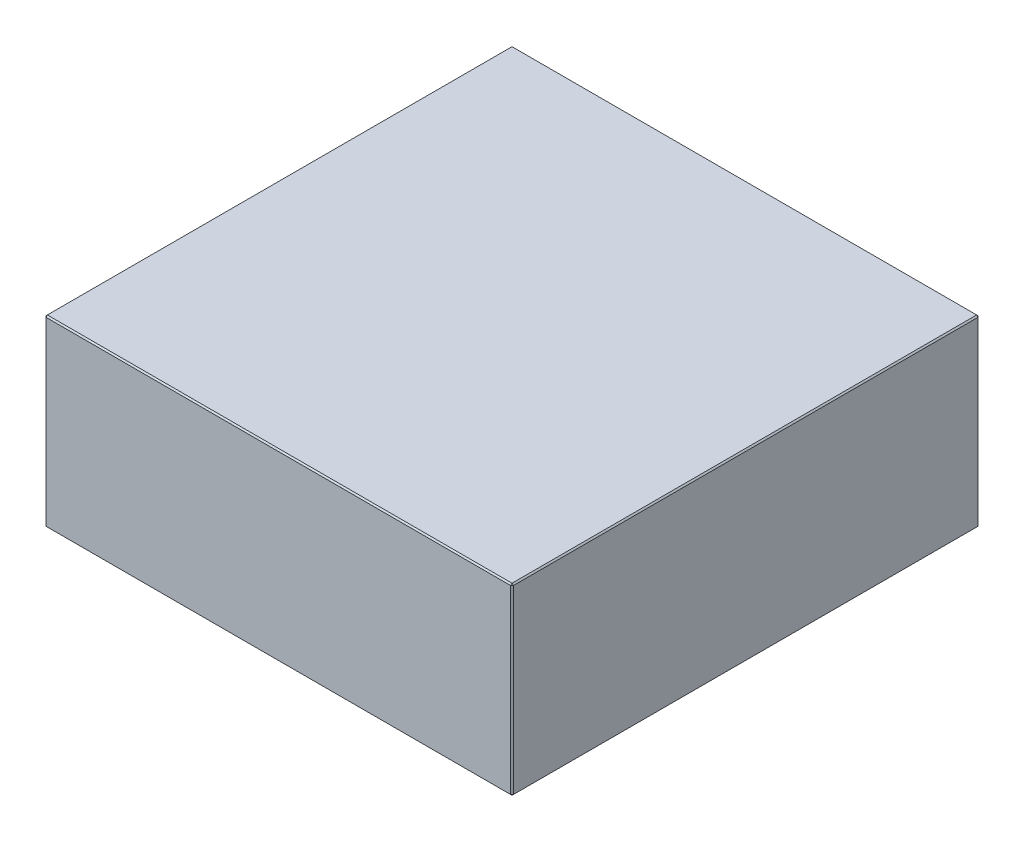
ISO-10303-21;
HEADER;
FILE_DESCRIPTION(('STEP AP214'),'2;1');
FILE_NAME('part.step','',(''),(''),'','','');
FILE_SCHEMA(('AUTOMOTIVE_DESIGN { 1 0 10303 214 1 1 1 1 }'));
ENDSEC;
DATA;
#1=APPLICATION_CONTEXT('core data for automotive mechanical design processes');
#2=APPLICATION_PROTOCOL_DEFINITION('international standard','automotive_design',2000,#1);
#3=PRODUCT_CONTEXT('',#1,'mechanical');
#4=PRODUCT('Part','Part','',(#3));
#5=PRODUCT_RELATED_PRODUCT_CATEGORY('part','',(#4));
#6=PRODUCT_DEFINITION_FORMATION('','',#4);
#7=PRODUCT_DEFINITION_CONTEXT('part definition',#1,'design');
#8=PRODUCT_DEFINITION('design','',#6,#7);
#9=PRODUCT_DEFINITION_SHAPE('','',#8);
#10=(LENGTH_UNIT() NAMED_UNIT(*) SI_UNIT(.MILLI.,.METRE.));
#11=(NAMED_UNIT(*) PLANE_ANGLE_UNIT() SI_UNIT($,.RADIAN.));
#12=(NAMED_UNIT(*) SI_UNIT($,.STERADIAN.) SOLID_ANGLE_UNIT());
#13=UNCERTAINTY_MEASURE_WITH_UNIT(LENGTH_MEASURE(1.E-05),#10,'distance_accuracy_value','');
#14=(GEOMETRIC_REPRESENTATION_CONTEXT(3) GLOBAL_UNCERTAINTY_ASSIGNED_CONTEXT((#13)) GLOBAL_UNIT_ASSIGNED_CONTEXT((#10,
#11,#12)) REPRESENTATION_CONTEXT('',''));
#15=CARTESIAN_POINT('',(0.,0.,0.));
#16=DIRECTION('',(0.,0.,1.));
#17=DIRECTION('',(1.,0.,0.));
#18=AXIS2_PLACEMENT_3D('',#15,#16,#17);
#19=CARTESIAN_POINT('',(-173.,136.,173.));
#20=DIRECTION('',(1.,0.,0.));
#21=DIRECTION('',(0.,0.,-1.));
#22=AXIS2_PLACEMENT_3D('',#19,#20,#21);
#23=PLANE('',#22);
#24=DIRECTION('',(0.,-1.,0.));
#25=VECTOR('',#24,1.);
#26=CARTESIAN_POINT('',(-173.,136.,-172.));
#27=LINE('',#26,#25);
#28=CARTESIAN_POINT('',(-173.,135.,-172.));
#29=VERTEX_POINT('',#28);
#30=CARTESIAN_POINT('',(-173.,1.,-172.));
#31=VERTEX_POINT('',#30);
#32=EDGE_CURVE('E114',#29,#31,#27,.T.);
#33=ORIENTED_EDGE('',*,*,#32,.T.);
#34=DIRECTION('',(0.,0.,1.));
#35=VECTOR('',#34,1.);
#36=CARTESIAN_POINT('',(-173.,1.,173.));
#37=LINE('',#36,#35);
#38=CARTESIAN_POINT('',(-173.,1.,172.));
#39=VERTEX_POINT('',#38);
#40=EDGE_CURVE('E110',#31,#39,#37,.T.);
#41=ORIENTED_EDGE('',*,*,#40,.T.);
#42=DIRECTION('',(0.,1.,0.));
#43=VECTOR('',#42,1.);
#44=CARTESIAN_POINT('',(-173.,136.,172.));
#45=LINE('',#44,#43);
#46=CARTESIAN_POINT('',(-173.,135.,172.));
#47=VERTEX_POINT('',#46);
#48=EDGE_CURVE('E103',#39,#47,#45,.T.);
#49=ORIENTED_EDGE('',*,*,#48,.T.);
#50=DIRECTION('',(0.,0.,-1.));
#51=VECTOR('',#50,1.);
#52=CARTESIAN_POINT('',(-173.,135.,-173.));
#53=LINE('',#52,#51);
#54=EDGE_CURVE('E107',#47,#29,#53,.T.);
#55=ORIENTED_EDGE('',*,*,#54,.T.);
#56=EDGE_LOOP('',(#33,#41,#49,#55));
#57=FACE_BOUND('',#56,.T.);
#58=ADVANCED_FACE('F15',(#57),#23,.F.);
#59=CARTESIAN_POINT('',(173.,136.,173.));
#60=DIRECTION('',(0.,0.,-1.));
#61=DIRECTION('',(-1.,0.,0.));
#62=AXIS2_PLACEMENT_3D('',#59,#60,#61);
#63=PLANE('',#62);
#64=DIRECTION('',(-1.,0.,0.));
#65=VECTOR('',#64,1.);
#66=CARTESIAN_POINT('',(-173.,135.,173.));
#67=LINE('',#66,#65);
#68=CARTESIAN_POINT('',(172.,135.,173.));
#69=VERTEX_POINT('',#68);
#70=CARTESIAN_POINT('',(-172.,135.,173.));
#71=VERTEX_POINT('',#70);
#72=EDGE_CURVE('E164',#69,#71,#67,.T.);
#73=ORIENTED_EDGE('',*,*,#72,.T.);
#74=DIRECTION('',(0.,-1.,0.));
#75=VECTOR('',#74,1.);
#76=CARTESIAN_POINT('',(-172.,136.,173.));
#77=LINE('',#76,#75);
#78=CARTESIAN_POINT('',(-172.,1.00000000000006,173.));
#79=VERTEX_POINT('',#78);
#80=EDGE_CURVE('E122',#71,#79,#77,.T.);
#81=ORIENTED_EDGE('',*,*,#80,.T.);
#82=DIRECTION('',(1.,0.,0.));
#83=VECTOR('',#82,1.);
#84=CARTESIAN_POINT('',(173.,1.00000000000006,173.));
#85=LINE('',#84,#83);
#86=CARTESIAN_POINT('',(172.,1.00000000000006,173.));
#87=VERTEX_POINT('',#86);
#88=EDGE_CURVE('E168',#79,#87,#85,.T.);
#89=ORIENTED_EDGE('',*,*,#88,.T.);
#90=DIRECTION('',(0.,1.,0.));
#91=VECTOR('',#90,1.);
#92=CARTESIAN_POINT('',(172.,136.,173.));
#93=LINE('',#92,#91);
#94=EDGE_CURVE('E166',#87,#69,#93,.T.);
#95=ORIENTED_EDGE('',*,*,#94,.T.);
#96=EDGE_LOOP('',(#73,#81,#89,#95));
#97=FACE_BOUND('',#96,.T.);
#98=ADVANCED_FACE('F275',(#97),#63,.F.);
#99=CARTESIAN_POINT('',(173.,136.,173.));
#100=DIRECTION('',(-1.,0.,0.));
#101=DIRECTION('',(0.,0.,1.));
#102=AXIS2_PLACEMENT_3D('',#99,#100,#101);
#103=PLANE('',#102);
#104=DIRECTION('',(0.,0.,-1.));
#105=VECTOR('',#104,1.);
#106=CARTESIAN_POINT('',(173.,1.00000000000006,173.));
#107=LINE('',#106,#105);
#108=CARTESIAN_POINT('',(173.,1.00000000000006,172.));
#109=VERTEX_POINT('',#108);
#110=CARTESIAN_POINT('',(173.,1.00000000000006,-172.));
#111=VERTEX_POINT('',#110);
#112=EDGE_CURVE('E159',#109,#111,#107,.T.);
#113=ORIENTED_EDGE('',*,*,#112,.T.);
#114=DIRECTION('',(0.,1.,0.));
#115=VECTOR('',#114,1.);
#116=CARTESIAN_POINT('',(173.,136.,-172.));
#117=LINE('',#116,#115);
#118=CARTESIAN_POINT('',(173.,135.,-172.));
#119=VERTEX_POINT('',#118);
#120=EDGE_CURVE('E161',#111,#119,#117,.T.);
#121=ORIENTED_EDGE('',*,*,#120,.T.);
#122=DIRECTION('',(0.,0.,1.));
#123=VECTOR('',#122,1.);
#124=CARTESIAN_POINT('',(173.,135.,173.));
#125=LINE('',#124,#123);
#126=CARTESIAN_POINT('',(173.,135.,172.));
#127=VERTEX_POINT('',#126);
#128=EDGE_CURVE('E155',#119,#127,#125,.T.);
#129=ORIENTED_EDGE('',*,*,#128,.T.);
#130=DIRECTION('',(0.,-1.,0.));
#131=VECTOR('',#130,1.);
#132=CARTESIAN_POINT('',(173.,136.,172.));
#133=LINE('',#132,#131);
#134=EDGE_CURVE('E157',#127,#109,#133,.T.);
#135=ORIENTED_EDGE('',*,*,#134,.T.);
#136=EDGE_LOOP('',(#113,#121,#129,#135));
#137=FACE_BOUND('',#136,.T.);
#138=ADVANCED_FACE('F254',(#137),#103,.F.);
#139=CARTESIAN_POINT('',(173.,136.,-173.));
#140=DIRECTION('',(0.,0.,1.));
#141=DIRECTION('',(1.,0.,0.));
#142=AXIS2_PLACEMENT_3D('',#139,#140,#141);
#143=PLANE('',#142);
#144=DIRECTION('',(0.,-1.,0.));
#145=VECTOR('',#144,1.);
#146=CARTESIAN_POINT('',(172.,136.,-173.));
#147=LINE('',#146,#145);
#148=CARTESIAN_POINT('',(172.,135.,-173.));
#149=VERTEX_POINT('',#148);
#150=CARTESIAN_POINT('',(172.,1.00000000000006,-173.));
#151=VERTEX_POINT('',#150);
#152=EDGE_CURVE('E148',#149,#151,#147,.T.);
#153=ORIENTED_EDGE('',*,*,#152,.T.);
#154=DIRECTION('',(-1.,0.,0.));
#155=VECTOR('',#154,1.);
#156=CARTESIAN_POINT('',(173.,1.00000000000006,-173.));
#157=LINE('',#156,#155);
#158=CARTESIAN_POINT('',(-172.,1.00000000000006,-173.));
#159=VERTEX_POINT('',#158);
#160=EDGE_CURVE('E153',#151,#159,#157,.T.);
#161=ORIENTED_EDGE('',*,*,#160,.T.);
#162=DIRECTION('',(0.,1.,0.));
#163=VECTOR('',#162,1.);
#164=CARTESIAN_POINT('',(-172.,136.,-173.));
#165=LINE('',#164,#163);
#166=CARTESIAN_POINT('',(-172.,135.,-173.));
#167=VERTEX_POINT('',#166);
#168=EDGE_CURVE('E150',#159,#167,#165,.T.);
#169=ORIENTED_EDGE('',*,*,#168,.T.);
#170=DIRECTION('',(1.,0.,0.));
#171=VECTOR('',#170,1.);
#172=CARTESIAN_POINT('',(173.,135.,-173.));
#173=LINE('',#172,#171);
#174=EDGE_CURVE('E146',#167,#149,#173,.T.);
#175=ORIENTED_EDGE('',*,*,#174,.T.);
#176=EDGE_LOOP('',(#153,#161,#169,#175));
#177=FACE_BOUND('',#176,.T.);
#178=ADVANCED_FACE('F284',(#177),#143,.F.);
#179=CARTESIAN_POINT('',(0.,136.,0.));
#180=DIRECTION('',(0.,1.,0.));
#181=DIRECTION('',(0.,0.,1.));
#182=AXIS2_PLACEMENT_3D('',#179,#180,#181);
#183=PLANE('',#182);
#184=DIRECTION('',(0.,0.,-1.));
#185=VECTOR('',#184,1.);
#186=CARTESIAN_POINT('',(172.,136.,-173.));
#187=LINE('',#186,#185);
#188=CARTESIAN_POINT('',(172.,136.,172.));
#189=VERTEX_POINT('',#188);
#190=CARTESIAN_POINT('',(172.,136.,-172.));
#191=VERTEX_POINT('',#190);
#192=EDGE_CURVE('E24',#189,#191,#187,.T.);
#193=ORIENTED_EDGE('',*,*,#192,.T.);
#194=DIRECTION('',(-1.,0.,0.));
#195=VECTOR('',#194,1.);
#196=CARTESIAN_POINT('',(-173.,136.,-172.));
#197=LINE('',#196,#195);
#198=CARTESIAN_POINT('',(-172.,136.,-172.));
#199=VERTEX_POINT('',#198);
#200=EDGE_CURVE('E9',#191,#199,#197,.T.);
#201=ORIENTED_EDGE('',*,*,#200,.T.);
#202=DIRECTION('',(0.,0.,1.));
#203=VECTOR('',#202,1.);
#204=CARTESIAN_POINT('',(-172.,136.,173.));
#205=LINE('',#204,#203);
#206=CARTESIAN_POINT('',(-172.,136.,172.));
#207=VERTEX_POINT('',#206);
#208=EDGE_CURVE('E180',#199,#207,#205,.T.);
#209=ORIENTED_EDGE('',*,*,#208,.T.);
#210=DIRECTION('',(1.,0.,0.));
#211=VECTOR('',#210,1.);
#212=CARTESIAN_POINT('',(173.,136.,172.));
#213=LINE('',#212,#211);
#214=EDGE_CURVE('E35',#207,#189,#213,.T.);
#215=ORIENTED_EDGE('',*,*,#214,.T.);
#216=EDGE_LOOP('',(#193,#201,#209,#215));
#217=FACE_BOUND('',#216,.T.);
#218=ADVANCED_FACE('F350',(#217),#183,.T.);
#219=CARTESIAN_POINT('',(0.,0.,0.));
#220=DIRECTION('',(0.,1.,0.));
#221=DIRECTION('',(0.,0.,1.));
#222=AXIS2_PLACEMENT_3D('',#219,#220,#221);
#223=PLANE('',#222);
#224=DIRECTION('',(0.,0.,1.));
#225=VECTOR('',#224,1.);
#226=CARTESIAN_POINT('',(172.,0.,0.));
#227=LINE('',#226,#225);
#228=CARTESIAN_POINT('',(172.,0.,-172.));
#229=VERTEX_POINT('',#228);
#230=CARTESIAN_POINT('',(172.,0.,172.));
#231=VERTEX_POINT('',#230);
#232=EDGE_CURVE('E171',#229,#231,#227,.T.);
#233=ORIENTED_EDGE('',*,*,#232,.T.);
#234=DIRECTION('',(-1.,0.,0.));
#235=VECTOR('',#234,1.);
#236=CARTESIAN_POINT('',(0.,0.,172.));
#237=LINE('',#236,#235);
#238=CARTESIAN_POINT('',(-172.,0.,172.));
#239=VERTEX_POINT('',#238);
#240=EDGE_CURVE('E177',#231,#239,#237,.T.);
#241=ORIENTED_EDGE('',*,*,#240,.T.);
#242=DIRECTION('',(0.,0.,-1.));
#243=VECTOR('',#242,1.);
#244=CARTESIAN_POINT('',(-172.,0.,0.));
#245=LINE('',#244,#243);
#246=CARTESIAN_POINT('',(-172.,0.,-172.));
#247=VERTEX_POINT('',#246);
#248=EDGE_CURVE('E175',#239,#247,#245,.T.);
#249=ORIENTED_EDGE('',*,*,#248,.T.);
#250=DIRECTION('',(1.,0.,0.));
#251=VECTOR('',#250,1.);
#252=CARTESIAN_POINT('',(0.,0.,-172.));
#253=LINE('',#252,#251);
#254=EDGE_CURVE('E173',#247,#229,#253,.T.);
#255=ORIENTED_EDGE('',*,*,#254,.T.);
#256=EDGE_LOOP('',(#233,#241,#249,#255));
#257=FACE_BOUND('',#256,.T.);
#258=ADVANCED_FACE('F246',(#257),#223,.F.);
#259=CARTESIAN_POINT('',(173.,136.,172.));
#260=DIRECTION('',(-0.707106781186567,0.,-0.707106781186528));
#261=DIRECTION('',(0.,-1.,0.));
#262=AXIS2_PLACEMENT_3D('',#259,#260,#261);
#263=PLANE('',#262);
#264=DIRECTION('',(-0.707106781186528,0.,0.707106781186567));
#265=VECTOR('',#264,1.);
#266=CARTESIAN_POINT('',(172.,135.,173.));
#267=LINE('',#266,#265);
#268=EDGE_CURVE('E19',#69,#127,#267,.F.);
#269=ORIENTED_EDGE('',*,*,#268,.F.);
#270=ORIENTED_EDGE('',*,*,#94,.F.);
#271=DIRECTION('',(0.707106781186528,0.,-0.707106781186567));
#272=VECTOR('',#271,1.);
#273=CARTESIAN_POINT('',(172.,1.00000000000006,173.));
#274=LINE('',#273,#272);
#275=EDGE_CURVE('E142',#109,#87,#274,.F.);
#276=ORIENTED_EDGE('',*,*,#275,.F.);
#277=ORIENTED_EDGE('',*,*,#134,.F.);
#278=EDGE_LOOP('',(#269,#270,#276,#277));
#279=FACE_BOUND('',#278,.T.);
#280=ADVANCED_FACE('F17',(#279),#263,.F.);
#281=CARTESIAN_POINT('',(172.,135.,173.));
#282=DIRECTION('',(0.577350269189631,0.577350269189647,0.577350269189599));
#283=DIRECTION('',(-0.707106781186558,0.707106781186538,0.));
#284=AXIS2_PLACEMENT_3D('',#281,#282,#283);
#285=PLANE('',#284);
#286=DIRECTION('',(0.,-0.707106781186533,0.707106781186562));
#287=VECTOR('',#286,1.);
#288=CARTESIAN_POINT('',(172.,135.,173.));
#289=LINE('',#288,#287);
#290=EDGE_CURVE('E226',#69,#189,#289,.F.);
#291=ORIENTED_EDGE('',*,*,#290,.F.);
#292=ORIENTED_EDGE('',*,*,#268,.T.);
#293=DIRECTION('',(-0.707106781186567,0.707106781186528,0.));
#294=VECTOR('',#293,1.);
#295=CARTESIAN_POINT('',(172.5,135.5,172.));
#296=LINE('',#295,#294);
#297=EDGE_CURVE('E228',#189,#127,#296,.F.);
#298=ORIENTED_EDGE('',*,*,#297,.F.);
#299=EDGE_LOOP('',(#291,#292,#298));
#300=FACE_BOUND('',#299,.T.);
#301=ADVANCED_FACE('F270',(#300),#285,.T.);
#302=CARTESIAN_POINT('',(172.,1.00000000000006,173.));
#303=DIRECTION('',(0.577350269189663,-0.577350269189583,0.577350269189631));
#304=DIRECTION('',(0.707106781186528,0.,-0.707106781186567));
#305=AXIS2_PLACEMENT_3D('',#302,#303,#304);
#306=PLANE('',#305);
#307=DIRECTION('',(-0.707106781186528,-0.707106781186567,0.));
#308=VECTOR('',#307,1.);
#309=CARTESIAN_POINT('',(172.5,0.500000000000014,172.));
#310=LINE('',#309,#308);
#311=EDGE_CURVE('E220',#109,#231,#310,.T.);
#312=ORIENTED_EDGE('',*,*,#311,.F.);
#313=ORIENTED_EDGE('',*,*,#275,.T.);
#314=DIRECTION('',(0.,0.707106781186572,0.707106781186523));
#315=VECTOR('',#314,1.);
#316=CARTESIAN_POINT('',(172.,1.00000000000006,173.));
#317=LINE('',#316,#315);
#318=EDGE_CURVE('E223',#231,#87,#317,.T.);
#319=ORIENTED_EDGE('',*,*,#318,.F.);
#320=EDGE_LOOP('',(#312,#313,#319));
#321=FACE_BOUND('',#320,.T.);
#322=ADVANCED_FACE('F235',(#321),#306,.T.);
#323=CARTESIAN_POINT('',(172.,136.,0.));
#324=DIRECTION('',(0.707106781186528,0.707106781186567,0.));
#325=DIRECTION('',(0.,0.,1.));
#326=AXIS2_PLACEMENT_3D('',#323,#324,#325);
#327=PLANE('',#326);
#328=ORIENTED_EDGE('',*,*,#297,.T.);
#329=ORIENTED_EDGE('',*,*,#128,.F.);
#330=DIRECTION('',(0.707106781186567,-0.707106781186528,0.));
#331=VECTOR('',#330,1.);
#332=CARTESIAN_POINT('',(173.,135.,-172.));
#333=LINE('',#332,#331);
#334=EDGE_CURVE('E215',#191,#119,#333,.T.);
#335=ORIENTED_EDGE('',*,*,#334,.F.);
#336=ORIENTED_EDGE('',*,*,#192,.F.);
#337=EDGE_LOOP('',(#328,#329,#335,#336));
#338=FACE_BOUND('',#337,.T.);
#339=ADVANCED_FACE('F265',(#338),#327,.T.);
#340=CARTESIAN_POINT('',(0.,136.,172.));
#341=DIRECTION('',(0.,0.707106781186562,0.707106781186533));
#342=DIRECTION('',(-1.,0.,0.));
#343=AXIS2_PLACEMENT_3D('',#340,#341,#342);
#344=PLANE('',#343);
#345=ORIENTED_EDGE('',*,*,#290,.T.);
#346=ORIENTED_EDGE('',*,*,#214,.F.);
#347=DIRECTION('',(0.,0.707106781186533,-0.707106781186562));
#348=VECTOR('',#347,1.);
#349=CARTESIAN_POINT('',(-172.,135.5,172.5));
#350=LINE('',#349,#348);
#351=EDGE_CURVE('E126',#71,#207,#350,.T.);
#352=ORIENTED_EDGE('',*,*,#351,.F.);
#353=ORIENTED_EDGE('',*,*,#72,.F.);
#354=EDGE_LOOP('',(#345,#346,#352,#353));
#355=FACE_BOUND('',#354,.T.);
#356=ADVANCED_FACE('F273',(#355),#344,.T.);
#357=CARTESIAN_POINT('',(-172.,136.,173.));
#358=DIRECTION('',(0.707106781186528,0.,-0.707106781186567));
#359=DIRECTION('',(0.,-1.,0.));
#360=AXIS2_PLACEMENT_3D('',#357,#358,#359);
#361=PLANE('',#360);
#362=DIRECTION('',(0.707106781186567,0.,0.707106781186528));
#363=VECTOR('',#362,1.);
#364=CARTESIAN_POINT('',(-172.,1.00000000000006,173.));
#365=LINE('',#364,#363);
#366=EDGE_CURVE('E127',#79,#39,#365,.F.);
#367=ORIENTED_EDGE('',*,*,#366,.F.);
#368=ORIENTED_EDGE('',*,*,#80,.F.);
#369=DIRECTION('',(-0.707106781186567,0.,-0.707106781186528));
#370=VECTOR('',#369,1.);
#371=CARTESIAN_POINT('',(-173.,135.,172.));
#372=LINE('',#371,#370);
#373=EDGE_CURVE('E118',#47,#71,#372,.F.);
#374=ORIENTED_EDGE('',*,*,#373,.F.);
#375=ORIENTED_EDGE('',*,*,#48,.F.);
#376=EDGE_LOOP('',(#367,#368,#374,#375));
#377=FACE_BOUND('',#376,.T.);
#378=ADVANCED_FACE('F120',(#377),#361,.F.);
#379=CARTESIAN_POINT('',(173.,1.00000000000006,173.));
#380=DIRECTION('',(0.,0.707106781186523,-0.707106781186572));
#381=DIRECTION('',(1.,0.,0.));
#382=AXIS2_PLACEMENT_3D('',#379,#380,#381);
#383=PLANE('',#382);
#384=ORIENTED_EDGE('',*,*,#318,.T.);
#385=ORIENTED_EDGE('',*,*,#88,.F.);
#386=DIRECTION('',(0.,-0.707106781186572,-0.707106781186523));
#387=VECTOR('',#386,1.);
#388=CARTESIAN_POINT('',(-172.,1.00000000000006,173.));
#389=LINE('',#388,#387);
#390=EDGE_CURVE('E211',#239,#79,#389,.F.);
#391=ORIENTED_EDGE('',*,*,#390,.F.);
#392=ORIENTED_EDGE('',*,*,#240,.F.);
#393=EDGE_LOOP('',(#384,#385,#391,#392));
#394=FACE_BOUND('',#393,.T.);
#395=ADVANCED_FACE('F243',(#394),#383,.F.);
#396=CARTESIAN_POINT('',(173.,1.00000000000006,173.));
#397=DIRECTION('',(-0.707106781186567,0.707106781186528,0.));
#398=DIRECTION('',(0.,0.,-1.));
#399=AXIS2_PLACEMENT_3D('',#396,#397,#398);
#400=PLANE('',#399);
#401=ORIENTED_EDGE('',*,*,#311,.T.);
#402=ORIENTED_EDGE('',*,*,#232,.F.);
#403=DIRECTION('',(0.707106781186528,0.707106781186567,0.));
#404=VECTOR('',#403,1.);
#405=CARTESIAN_POINT('',(172.5,0.500000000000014,-172.));
#406=LINE('',#405,#404);
#407=EDGE_CURVE('E208',#111,#229,#406,.F.);
#408=ORIENTED_EDGE('',*,*,#407,.F.);
#409=ORIENTED_EDGE('',*,*,#112,.F.);
#410=EDGE_LOOP('',(#401,#402,#408,#409));
#411=FACE_BOUND('',#410,.T.);
#412=ADVANCED_FACE('F251',(#411),#400,.F.);
#413=CARTESIAN_POINT('',(172.,136.,-173.));
#414=DIRECTION('',(-0.707106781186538,0.,0.707106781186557));
#415=DIRECTION('',(0.,-1.,0.));
#416=AXIS2_PLACEMENT_3D('',#413,#414,#415);
#417=PLANE('',#416);
#418=DIRECTION('',(0.707106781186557,0.,0.707106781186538));
#419=VECTOR('',#418,1.);
#420=CARTESIAN_POINT('',(173.,135.,-172.));
#421=LINE('',#420,#419);
#422=EDGE_CURVE('E217',#119,#149,#421,.F.);
#423=ORIENTED_EDGE('',*,*,#422,.F.);
#424=ORIENTED_EDGE('',*,*,#120,.F.);
#425=DIRECTION('',(-0.707106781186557,0.,-0.707106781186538));
#426=VECTOR('',#425,1.);
#427=CARTESIAN_POINT('',(172.,1.00000000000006,-173.));
#428=LINE('',#427,#426);
#429=EDGE_CURVE('E205',#151,#111,#428,.F.);
#430=ORIENTED_EDGE('',*,*,#429,.F.);
#431=ORIENTED_EDGE('',*,*,#152,.F.);
#432=EDGE_LOOP('',(#423,#424,#430,#431));
#433=FACE_BOUND('',#432,.T.);
#434=ADVANCED_FACE('F258',(#433),#417,.F.);
#435=CARTESIAN_POINT('',(173.,135.,-172.));
#436=DIRECTION('',(0.577350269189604,0.577350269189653,-0.57735026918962));
#437=DIRECTION('',(0.,0.707106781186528,0.707106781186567));
#438=AXIS2_PLACEMENT_3D('',#435,#436,#437);
#439=PLANE('',#438);
#440=ORIENTED_EDGE('',*,*,#334,.T.);
#441=ORIENTED_EDGE('',*,*,#422,.T.);
#442=DIRECTION('',(0.,0.707106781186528,0.707106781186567));
#443=VECTOR('',#442,1.);
#444=CARTESIAN_POINT('',(172.,135.5,-172.5));
#445=LINE('',#444,#443);
#446=EDGE_CURVE('E134',#191,#149,#445,.F.);
#447=ORIENTED_EDGE('',*,*,#446,.F.);
#448=EDGE_LOOP('',(#440,#441,#447));
#449=FACE_BOUND('',#448,.T.);
#450=ADVANCED_FACE('F325',(#449),#439,.T.);
#451=CARTESIAN_POINT('',(-173.,135.,172.));
#452=DIRECTION('',(-0.577350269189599,0.577350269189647,0.577350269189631));
#453=DIRECTION('',(0.,-0.707106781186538,0.707106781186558));
#454=AXIS2_PLACEMENT_3D('',#451,#452,#453);
#455=PLANE('',#454);
#456=ORIENTED_EDGE('',*,*,#373,.T.);
#457=ORIENTED_EDGE('',*,*,#351,.T.);
#458=DIRECTION('',(-0.707106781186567,-0.707106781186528,0.));
#459=VECTOR('',#458,1.);
#460=CARTESIAN_POINT('',(-173.,135.,172.));
#461=LINE('',#460,#459);
#462=EDGE_CURVE('E130',#47,#207,#461,.F.);
#463=ORIENTED_EDGE('',*,*,#462,.F.);
#464=EDGE_LOOP('',(#456,#457,#463));
#465=FACE_BOUND('',#464,.T.);
#466=ADVANCED_FACE('F131',(#465),#455,.T.);
#467=CARTESIAN_POINT('',(-172.,1.00000000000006,173.));
#468=DIRECTION('',(-0.577350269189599,-0.577350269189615,0.577350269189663));
#469=DIRECTION('',(0.,-0.707106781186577,-0.707106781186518));
#470=AXIS2_PLACEMENT_3D('',#467,#468,#469);
#471=PLANE('',#470);
#472=ORIENTED_EDGE('',*,*,#390,.T.);
#473=ORIENTED_EDGE('',*,*,#366,.T.);
#474=DIRECTION('',(-0.707106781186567,0.707106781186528,0.));
#475=VECTOR('',#474,1.);
#476=CARTESIAN_POINT('',(-172.5,0.499999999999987,172.));
#477=LINE('',#476,#475);
#478=EDGE_CURVE('E135',#239,#39,#477,.T.);
#479=ORIENTED_EDGE('',*,*,#478,.F.);
#480=EDGE_LOOP('',(#472,#473,#479));
#481=FACE_BOUND('',#480,.T.);
#482=ADVANCED_FACE('F318',(#481),#471,.T.);
#483=CARTESIAN_POINT('',(172.,1.00000000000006,-173.));
#484=DIRECTION('',(0.577350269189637,-0.577350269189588,-0.577350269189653));
#485=DIRECTION('',(-0.707106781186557,0.,-0.707106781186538));
#486=AXIS2_PLACEMENT_3D('',#483,#484,#485);
#487=PLANE('',#486);
#488=ORIENTED_EDGE('',*,*,#429,.T.);
#489=ORIENTED_EDGE('',*,*,#407,.T.);
#490=DIRECTION('',(0.,-0.707106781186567,0.707106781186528));
#491=VECTOR('',#490,1.);
#492=CARTESIAN_POINT('',(172.,1.00000000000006,-173.));
#493=LINE('',#492,#491);
#494=EDGE_CURVE('E198',#151,#229,#493,.T.);
#495=ORIENTED_EDGE('',*,*,#494,.F.);
#496=EDGE_LOOP('',(#488,#489,#495));
#497=FACE_BOUND('',#496,.T.);
#498=ADVANCED_FACE('F314',(#497),#487,.T.);
#499=CARTESIAN_POINT('',(0.,136.,-172.));
#500=DIRECTION('',(0.,0.707106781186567,-0.707106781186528));
#501=DIRECTION('',(1.,0.,0.));
#502=AXIS2_PLACEMENT_3D('',#499,#500,#501);
#503=PLANE('',#502);
#504=ORIENTED_EDGE('',*,*,#446,.T.);
#505=ORIENTED_EDGE('',*,*,#174,.F.);
#506=DIRECTION('',(0.,-0.707106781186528,-0.707106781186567));
#507=VECTOR('',#506,1.);
#508=CARTESIAN_POINT('',(-172.,135.,-173.));
#509=LINE('',#508,#507);
#510=EDGE_CURVE('E195',#199,#167,#509,.T.);
#511=ORIENTED_EDGE('',*,*,#510,.F.);
#512=ORIENTED_EDGE('',*,*,#200,.F.);
#513=EDGE_LOOP('',(#504,#505,#511,#512));
#514=FACE_BOUND('',#513,.T.);
#515=ADVANCED_FACE('F311',(#514),#503,.T.);
#516=CARTESIAN_POINT('',(-172.,136.,0.));
#517=DIRECTION('',(-0.707106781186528,0.707106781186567,0.));
#518=DIRECTION('',(0.,0.,-1.));
#519=AXIS2_PLACEMENT_3D('',#516,#517,#518);
#520=PLANE('',#519);
#521=ORIENTED_EDGE('',*,*,#462,.T.);
#522=ORIENTED_EDGE('',*,*,#208,.F.);
#523=DIRECTION('',(0.707106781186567,0.707106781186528,0.));
#524=VECTOR('',#523,1.);
#525=CARTESIAN_POINT('',(-172.5,135.5,-172.));
#526=LINE('',#525,#524);
#527=EDGE_CURVE('E138',#29,#199,#526,.T.);
#528=ORIENTED_EDGE('',*,*,#527,.F.);
#529=ORIENTED_EDGE('',*,*,#54,.F.);
#530=EDGE_LOOP('',(#521,#522,#528,#529));
#531=FACE_BOUND('',#530,.T.);
#532=ADVANCED_FACE('F137',(#531),#520,.T.);
#533=CARTESIAN_POINT('',(-173.,1.,173.));
#534=DIRECTION('',(0.707106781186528,0.707106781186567,0.));
#535=DIRECTION('',(0.,0.,1.));
#536=AXIS2_PLACEMENT_3D('',#533,#534,#535);
#537=PLANE('',#536);
#538=ORIENTED_EDGE('',*,*,#478,.T.);
#539=ORIENTED_EDGE('',*,*,#40,.F.);
#540=DIRECTION('',(0.707106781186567,-0.707106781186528,0.));
#541=VECTOR('',#540,1.);
#542=CARTESIAN_POINT('',(-173.,1.,-172.));
#543=LINE('',#542,#541);
#544=EDGE_CURVE('E191',#247,#31,#543,.F.);
#545=ORIENTED_EDGE('',*,*,#544,.F.);
#546=ORIENTED_EDGE('',*,*,#248,.F.);
#547=EDGE_LOOP('',(#538,#539,#545,#546));
#548=FACE_BOUND('',#547,.T.);
#549=ADVANCED_FACE('F304',(#548),#537,.F.);
#550=CARTESIAN_POINT('',(173.,1.00000000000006,-173.));
#551=DIRECTION('',(0.,0.707106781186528,0.707106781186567));
#552=DIRECTION('',(-1.,0.,0.));
#553=AXIS2_PLACEMENT_3D('',#550,#551,#552);
#554=PLANE('',#553);
#555=ORIENTED_EDGE('',*,*,#494,.T.);
#556=ORIENTED_EDGE('',*,*,#254,.F.);
#557=DIRECTION('',(0.,0.707106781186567,-0.707106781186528));
#558=VECTOR('',#557,1.);
#559=CARTESIAN_POINT('',(-172.,0.500000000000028,-172.5));
#560=LINE('',#559,#558);
#561=EDGE_CURVE('E188',#159,#247,#560,.F.);
#562=ORIENTED_EDGE('',*,*,#561,.F.);
#563=ORIENTED_EDGE('',*,*,#160,.F.);
#564=EDGE_LOOP('',(#555,#556,#562,#563));
#565=FACE_BOUND('',#564,.T.);
#566=ADVANCED_FACE('F300',(#565),#554,.F.);
#567=CARTESIAN_POINT('',(-172.,135.,-173.));
#568=DIRECTION('',(-0.577350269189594,0.577350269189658,-0.577350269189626));
#569=DIRECTION('',(0.,0.707106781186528,0.707106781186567));
#570=AXIS2_PLACEMENT_3D('',#567,#568,#569);
#571=PLANE('',#570);
#572=ORIENTED_EDGE('',*,*,#527,.T.);
#573=ORIENTED_EDGE('',*,*,#510,.T.);
#574=DIRECTION('',(0.707106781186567,0.,-0.707106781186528));
#575=VECTOR('',#574,1.);
#576=CARTESIAN_POINT('',(-172.,135.,-173.));
#577=LINE('',#576,#575);
#578=EDGE_CURVE('E186',#29,#167,#577,.T.);
#579=ORIENTED_EDGE('',*,*,#578,.F.);
#580=EDGE_LOOP('',(#572,#573,#579));
#581=FACE_BOUND('',#580,.T.);
#582=ADVANCED_FACE('F296',(#581),#571,.T.);
#583=CARTESIAN_POINT('',(-173.,1.,-172.));
#584=DIRECTION('',(-0.577350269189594,-0.577350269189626,-0.577350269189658));
#585=DIRECTION('',(0.,0.707106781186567,-0.707106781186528));
#586=AXIS2_PLACEMENT_3D('',#583,#584,#585);
#587=PLANE('',#586);
#588=ORIENTED_EDGE('',*,*,#561,.T.);
#589=ORIENTED_EDGE('',*,*,#544,.T.);
#590=DIRECTION('',(-0.707106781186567,0.,0.707106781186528));
#591=VECTOR('',#590,1.);
#592=CARTESIAN_POINT('',(-173.,1.,-172.));
#593=LINE('',#592,#591);
#594=EDGE_CURVE('E184',#159,#31,#593,.T.);
#595=ORIENTED_EDGE('',*,*,#594,.F.);
#596=EDGE_LOOP('',(#588,#589,#595));
#597=FACE_BOUND('',#596,.T.);
#598=ADVANCED_FACE('F292',(#597),#587,.T.);
#599=CARTESIAN_POINT('',(-173.,136.,-172.));
#600=DIRECTION('',(0.707106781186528,0.,0.707106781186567));
#601=DIRECTION('',(0.,-1.,0.));
#602=AXIS2_PLACEMENT_3D('',#599,#600,#601);
#603=PLANE('',#602);
#604=ORIENTED_EDGE('',*,*,#578,.T.);
#605=ORIENTED_EDGE('',*,*,#168,.F.);
#606=ORIENTED_EDGE('',*,*,#594,.T.);
#607=ORIENTED_EDGE('',*,*,#32,.F.);
#608=EDGE_LOOP('',(#604,#605,#606,#607));
#609=FACE_BOUND('',#608,.T.);
#610=ADVANCED_FACE('F289',(#609),#603,.F.);
#611=CLOSED_SHELL('',(#58,#98,#138,#178,#218,#258,#280,#301,#322,#339,#356,#378,#395,#412,#434,
#450,#466,#482,#498,#515,#532,#549,#566,#582,#598,#610));
#612=MANIFOLD_SOLID_BREP('B1',#611);
#613=ADVANCED_BREP_SHAPE_REPRESENTATION('',(#18,#612),#14);
#614=SHAPE_DEFINITION_REPRESENTATION(#9,#613);
ENDSEC;
END-ISO-10303-21;
